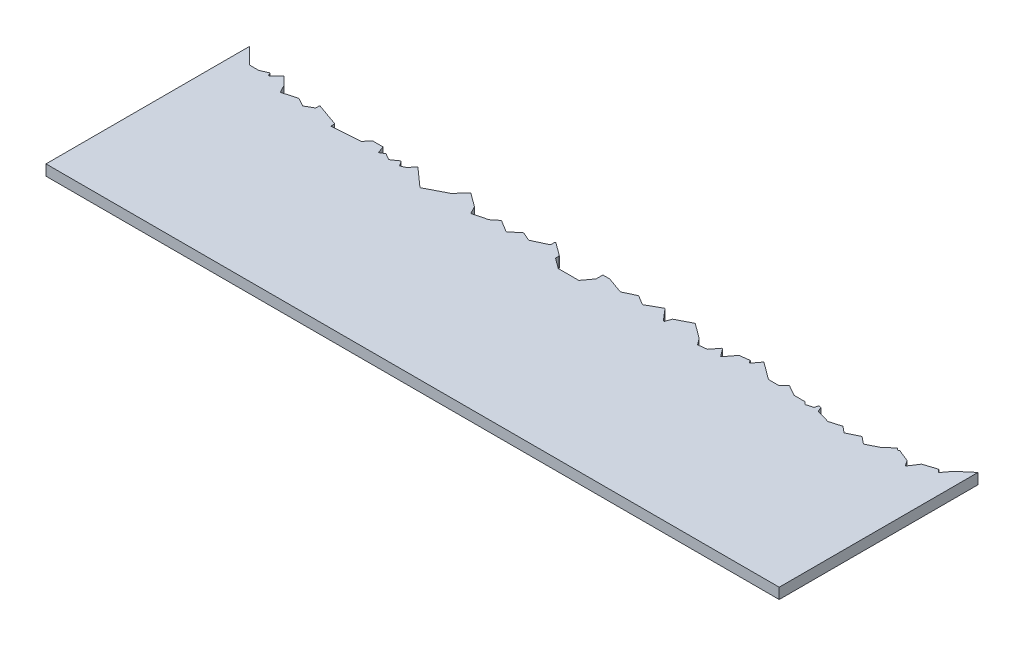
from build123d import *

# Parameters (mm, degrees)
BOSS_EXTRU_1_DEPTH      = 10
ENL_V_MAT_EXTRU_1_REACH = 1433.503
ESQUISSE2_W             = 10
ESQUISSE2_H             = 380


with BuildPart() as part:
    # Esquisse1 → Boss.-Extru.1 (new, symmetric)
    with BuildSketch(Plane(origin=(0, 0, 0), x_dir=(1, 0, 0), z_dir=(0, 1, 0))):
        with BuildLine():
            Line((0, 380), (29.60780348, 350.39219652))
            ThreePointArc((29.60780348, 350.39219652), (29.964813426, 350.153650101), (30.38593537, 350.069883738))
            Line((30.38593537, 350.069883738), (47.204004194, 350.069883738))
            ThreePointArc((47.204004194, 350.069883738), (47.428275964, 350.092979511), (47.643133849, 350.161297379))
            Line((47.643133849, 350.161297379), (61.096251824, 356.016085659))
            ThreePointArc((61.096251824, 356.016085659), (61.921316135, 356.037604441), (62.529286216, 355.479422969))
            Line((62.529286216, 355.479422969), (64.430876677, 351.478308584))
            ThreePointArc((64.430876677, 351.478308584), (65.237665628, 350.866257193), (66.202913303, 351.172545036))
            Line((66.202913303, 351.172545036), (79.287178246, 364.256809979))
            ThreePointArc((79.287178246, 364.256809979), (80.065310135, 364.579122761), (80.843442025, 364.256809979))
            Line((80.843442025, 364.256809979), (94.908965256, 350.191286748))
            ThreePointArc((94.908965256, 350.191286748), (95.019616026, 350.062033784), (95.109019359, 349.917268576))
            Line((95.109019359, 349.917268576), (102.574819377, 335.43057491))
            ThreePointArc((102.574819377, 335.43057491), (103.114892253, 334.925215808), (103.852885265, 334.875891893))
            Line((103.852885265, 334.875891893), (129.804389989, 342.226060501))
            ThreePointArc((129.804389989, 342.226060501), (130.232400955, 342.260223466), (130.640905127, 342.127993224))
            Line((130.640905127, 342.127993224), (145.531335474, 333.810636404))
            ThreePointArc((145.531335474, 333.810636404), (146.073891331, 333.670937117), (146.614912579, 333.816466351))
            Line((146.614912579, 333.816466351), (160.960487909, 342.033242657))
            ThreePointArc((160.960487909, 342.033242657), (161.365611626, 342.436282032), (161.513990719, 342.988142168))
            Line((161.513990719, 342.988142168), (161.513990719, 348.511023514))
            ThreePointArc((161.513990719, 348.511023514), (161.979799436, 349.41003168), (162.982879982, 349.547955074))
            Line((162.982879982, 349.547955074), (204.233333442, 334.890761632))
            ThreePointArc((204.233333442, 334.890761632), (204.763897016, 334.488466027), (204.965333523, 333.853830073))
            Line((204.965333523, 333.853830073), (204.965333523, 328.094555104))
            ThreePointArc((204.965333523, 328.094555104), (205.316437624, 327.288659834), (206.145705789, 326.997016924))
            Line((206.145705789, 326.997016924), (257.521561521, 330.73843443))
            ThreePointArc((257.521561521, 330.73843443), (257.928310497, 330.848995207), (258.263656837, 331.104360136))
            Line((258.263656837, 331.104360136), (267.944420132, 341.981442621))
            ThreePointArc((267.944420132, 341.981442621), (268.315954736, 342.253841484), (268.766443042, 342.35027482))
            Line((268.766443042, 342.35027482), (286.634683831, 342.35027482))
            ThreePointArc((286.634683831, 342.35027482), (287.269646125, 342.148607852), (287.671882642, 341.617521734))
            Line((287.671882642, 341.617521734), (291.760826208, 330.083269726))
            ThreePointArc((291.760826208, 330.083269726), (292.41554462, 329.419124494), (293.344966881, 329.496061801))
            Line((293.344966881, 329.496061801), (300.725341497, 333.723350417))
            ThreePointArc((300.725341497, 333.723350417), (301.266362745, 333.86887965), (301.808918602, 333.729180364))
            Line((301.808918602, 333.729180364), (312.937974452, 327.512816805))
            ThreePointArc((312.937974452, 327.512816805), (313.527040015, 327.374351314), (314.100251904, 327.568256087))
            Line((314.100251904, 327.568256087), (326.206634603, 335.934925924))
            ThreePointArc((326.206634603, 335.934925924), (327.030017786, 336.112168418), (327.737566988, 335.655277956))
            Line((327.737566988, 335.655277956), (333.256366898, 327.669698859))
            ThreePointArc((333.256366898, 327.669698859), (333.869640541, 327.234348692), (334.619311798, 327.294576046))
            Line((334.619311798, 327.294576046), (342.010502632, 330.674603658))
            ThreePointArc((342.010502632, 330.674603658), (342.206686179, 330.790228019), (342.374870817, 330.943756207))
            Line((342.374870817, 330.943756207), (351.795227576, 341.52825191))
            ThreePointArc((351.795227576, 341.52825191), (352.553320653, 341.895225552), (353.348862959, 341.618662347))
            Line((353.348862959, 341.618662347), (365.537201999, 330.770861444))
            Line((365.537201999, 330.770861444), (387.319156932, 311.384601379))
            ThreePointArc((387.319156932, 311.384601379), (387.912799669, 311.114862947), (388.554883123, 311.228438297))
            Line((388.554883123, 311.228438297), (426.293268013, 330.677129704))
            ThreePointArc((426.293268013, 330.677129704), (426.463586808, 330.785764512), (426.611177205, 330.923703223))
            Line((426.611177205, 330.923703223), (442.983894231, 349.319710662))
            ThreePointArc((442.983894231, 349.319710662), (443.691900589, 349.682620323), (444.459503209, 349.473425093))
            Line((444.459503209, 349.473425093), (456.722480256, 340.420372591))
            Line((456.722480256, 340.420372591), (469.586571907, 330.923551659))
            ThreePointArc((469.586571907, 330.923551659), (469.770840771, 330.751651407), (469.911171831, 330.542338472))
            Line((469.911171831, 330.542338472), (476.793211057, 317.188378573))
            ThreePointArc((476.793211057, 317.188378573), (477.325075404, 316.68662179), (478.053988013, 316.628950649))
            Line((478.053988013, 316.628950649), (504.009135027, 323.5254272))
            ThreePointArc((504.009135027, 323.5254272), (504.22665908, 323.608732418), (504.421776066, 323.735955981))
            Line((504.421776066, 323.735955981), (516.44666057, 333.536610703))
            ThreePointArc((516.44666057, 333.536610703), (517.071464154, 333.781786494), (517.722467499, 333.618430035))
            Line((517.722467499, 333.618430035), (538.99324515, 320.408272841))
            ThreePointArc((538.99324515, 320.408272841), (539.644248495, 320.244916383), (540.26905208, 320.490092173))
            Line((540.26905208, 320.490092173), (557.2893489, 334.36216324))
            ThreePointArc((557.2893489, 334.36216324), (557.839434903, 334.599980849), (558.432568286, 334.514280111))
            Line((558.432568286, 334.514280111), (573.953871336, 327.596418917))
            ThreePointArc((573.953871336, 327.596418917), (574.411679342, 327.501147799), (574.867714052, 327.604574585))
            Line((574.867714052, 327.604574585), (601.660133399, 340.123848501))
            ThreePointArc((601.660133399, 340.123848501), (602.122617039, 340.529920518), (602.294722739, 341.120822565))
            Line((602.294722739, 341.120822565), (602.294722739, 347.889656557))
            ThreePointArc((602.294722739, 347.889656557), (602.899313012, 348.872055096), (604.048753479, 348.774983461))
            Line((604.048753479, 348.774983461), (627.989706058, 331.100751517))
            ThreePointArc((627.989706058, 331.100751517), (628.31851853, 330.711279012), (628.436564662, 330.215424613))
            Line((628.436564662, 330.215424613), (628.436564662, 324.141706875))
            ThreePointArc((628.436564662, 324.141706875), (628.554610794, 323.645852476), (628.883423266, 323.256379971))
            Line((628.883423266, 323.256379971), (647.609211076, 309.432205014))
            ThreePointArc((647.609211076, 309.432205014), (647.918758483, 309.272249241), (648.262797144, 309.217087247))
            Line((648.262797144, 309.217087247), (685.840229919, 309.217087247))
            ThreePointArc((685.840229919, 309.217087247), (686.336084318, 309.335133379), (686.725556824, 309.663945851))
            Line((686.725556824, 309.663945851), (699.784882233, 327.353692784))
            ThreePointArc((699.784882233, 327.353692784), (699.944838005, 327.663240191), (700, 328.007278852))
            Line((700, 328.007278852), (700, 339.319927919))
            ThreePointArc((700, 339.319927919), (700.322312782, 340.098059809), (701.100444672, 340.420372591))
            Line((701.100444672, 340.420372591), (712.706722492, 340.420372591))
            ThreePointArc((712.706722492, 340.420372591), (712.893661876, 340.404378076), (713.075167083, 340.356859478))
            Line((713.075167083, 340.356859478), (743.409644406, 329.578352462))
            ThreePointArc((743.409644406, 329.578352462), (743.834528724, 329.516287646), (744.250819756, 329.62155161))
            Line((744.250819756, 329.62155161), (766.414033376, 340.164865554))
            ThreePointArc((766.414033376, 340.164865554), (766.94339493, 340.270119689), (767.45913389, 340.111011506))
            Line((767.45913389, 340.111011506), (784.455939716, 329.760249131))
            ThreePointArc((784.455939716, 329.760249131), (785.008399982, 329.59986294), (785.566301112, 329.740156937))
            Line((785.566301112, 329.740156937), (811.296301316, 344.159896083))
            ThreePointArc((811.296301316, 344.159896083), (812.028959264, 344.283015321), (812.672891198, 343.912478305))
            Line((812.672891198, 343.912478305), (824.982210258, 329.425729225))
            Line((824.982210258, 329.425729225), (830.906013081, 322.971360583))
            ThreePointArc((830.906013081, 322.971360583), (831.936000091, 322.637073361), (832.753685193, 323.347011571))
            Line((832.753685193, 323.347011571), (836.404773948, 333.622448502))
            ThreePointArc((836.404773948, 333.622448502), (836.613061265, 333.978108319), (836.93759179, 334.232189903))
            Line((836.93759179, 334.232189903), (863.978558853, 348.167906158))
            ThreePointArc((863.978558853, 348.167906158), (864.570656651, 348.286641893), (865.136258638, 348.07504707))
            Line((865.136258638, 348.07504707), (892.677648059, 327.74281914))
            ThreePointArc((892.677648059, 327.74281914), (892.801393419, 327.636423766), (892.908043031, 327.512897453))
            Line((892.908043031, 327.512897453), (901.137634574, 316.413195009))
            ThreePointArc((901.137634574, 316.413195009), (901.590767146, 316.056005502), (902.162345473, 315.977191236))
            Line((902.162345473, 315.977191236), (917.650773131, 317.974319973))
            ThreePointArc((917.650773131, 317.974319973), (918.057724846, 318.111253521), (918.381297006, 318.393497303))
            Line((918.381297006, 318.393497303), (929.559289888, 332.880866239))
            ThreePointArc((929.559289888, 332.880866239), (930.441092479, 333.30902869), (931.314524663, 332.864039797))
            Line((931.314524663, 332.864039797), (941.444414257, 319.201300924))
            ThreePointArc((941.444414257, 319.201300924), (942.31784644, 318.756312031), (943.199649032, 319.184474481))
            Line((943.199649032, 319.184474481), (957.100476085, 337.20080462))
            ThreePointArc((957.100476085, 337.20080462), (957.424048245, 337.483048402), (957.83099996, 337.61998195))
            Line((957.83099996, 337.61998195), (975.421695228, 339.888183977))
            ThreePointArc((975.421695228, 339.888183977), (976.060281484, 339.77816048), (976.526239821, 339.327849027))
            Line((976.526239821, 339.327849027), (978.614961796, 335.537151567))
            ThreePointArc((978.614961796, 335.537151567), (979.506027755, 334.970188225), (980.464103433, 335.414639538))
            Line((980.464103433, 335.414639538), (990.629643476, 349.184556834))
            ThreePointArc((990.629643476, 349.184556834), (991.351104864, 349.619146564), (992.168556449, 349.41629767))
            Line((992.168556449, 349.41629767), (1013.006650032, 334.032728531))
            Line((1013.006650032, 334.032728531), (1023.551882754, 326.247788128))
            ThreePointArc((1023.551882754, 326.247788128), (1023.861430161, 326.087832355), (1024.205468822, 326.03267036))
            Line((1024.205468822, 326.03267036), (1043.295181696, 326.03267036))
            ThreePointArc((1043.295181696, 326.03267036), (1043.71630364, 326.116436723), (1044.073313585, 326.354983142))
            Line((1044.073313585, 326.354983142), (1052.848396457, 335.130066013))
            ThreePointArc((1052.848396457, 335.130066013), (1053.47880231, 335.442418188), (1054.169589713, 335.309045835))
            Line((1054.169589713, 335.309045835), (1073.24956889, 324.483141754))
            ThreePointArc((1073.24956889, 324.483141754), (1073.511801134, 324.376245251), (1073.792630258, 324.339808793))
            Line((1073.792630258, 324.339808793), (1093.698125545, 324.339808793))
            ThreePointArc((1093.698125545, 324.339808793), (1094.11924749, 324.256042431), (1094.476257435, 324.017496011))
            Line((1094.476257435, 324.017496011), (1098.290549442, 320.203204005))
            ThreePointArc((1098.290549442, 320.203204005), (1098.797611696, 319.914799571), (1099.38084548, 319.926095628))
            Line((1099.38084548, 319.926095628), (1111.169974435, 323.413588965))
            ThreePointArc((1111.169974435, 323.413588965), (1111.641755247, 323.696554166), (1111.917613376, 324.172525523))
            Line((1111.917613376, 324.172525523), (1113.400502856, 329.476444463))
            ThreePointArc((1113.400502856, 329.476444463), (1113.920430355, 330.139053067), (1114.756609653, 330.239943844))
            Line((1114.756609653, 330.239943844), (1118.369308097, 329.229892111))
            ThreePointArc((1118.369308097, 329.229892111), (1118.845279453, 328.954033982), (1119.128244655, 328.48225317))
            Line((1119.128244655, 328.48225317), (1121.073124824, 321.907776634))
            ThreePointArc((1121.073124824, 321.907776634), (1121.35054724, 321.44149498), (1121.817052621, 321.164448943))
            Line((1121.817052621, 321.164448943), (1147.146845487, 313.693542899))
            ThreePointArc((1147.146845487, 313.693542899), (1147.458601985, 313.648590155), (1147.770322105, 313.693794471))
            Line((1147.770322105, 313.693794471), (1168.431597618, 319.805871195))
            ThreePointArc((1168.431597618, 319.805871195), (1168.957974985, 319.83002482), (1169.435236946, 319.606691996))
            Line((1169.435236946, 319.606691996), (1180.335773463, 310.801887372))
            ThreePointArc((1180.335773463, 310.801887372), (1180.903516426, 310.564482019), (1181.509952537, 310.669022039))
            Line((1181.509952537, 310.669022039), (1202.729726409, 321.026585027))
            ThreePointArc((1202.729726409, 321.026585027), (1203.336162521, 321.131125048), (1203.903905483, 320.893719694))
            Line((1203.903905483, 320.893719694), (1216.397809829, 310.801887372))
            ThreePointArc((1216.397809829, 310.801887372), (1216.965552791, 310.564482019), (1217.571988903, 310.669022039))
            Line((1217.571988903, 310.669022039), (1239.273834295, 321.261888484))
            ThreePointArc((1239.273834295, 321.261888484), (1239.414257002, 321.343791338), (1239.54108151, 321.44548774))
            Line((1239.54108151, 321.44548774), (1254.173624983, 335.071865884))
            ThreePointArc((1254.173624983, 335.071865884), (1254.884867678, 335.366302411), (1255.615051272, 335.122599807))
            Line((1255.615051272, 335.122599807), (1258.40403814, 332.869822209))
            ThreePointArc((1258.40403814, 332.869822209), (1259.235669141, 332.634400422), (1259.980840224, 333.072297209))
            Line((1259.980840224, 333.072297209), (1260.183966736, 333.347445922))
            ThreePointArc((1260.183966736, 333.347445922), (1260.769254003, 333.752611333), (1261.48008945, 333.714754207))
            Line((1261.48008945, 333.714754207), (1284.150869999, 324.592300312))
            ThreePointArc((1284.150869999, 324.592300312), (1284.434418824, 324.425141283), (1284.655847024, 324.181601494))
            Line((1284.655847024, 324.181601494), (1290.784784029, 314.983379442))
            ThreePointArc((1290.784784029, 314.983379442), (1291.703286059, 314.493133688), (1292.619345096, 314.98792932))
            Line((1292.619345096, 314.98792932), (1303.717779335, 331.82468969))
            ThreePointArc((1303.717779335, 331.82468969), (1303.970558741, 332.095063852), (1304.298684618, 332.266332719))
            Line((1304.298684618, 332.266332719), (1327.528397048, 339.760850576))
            ThreePointArc((1327.528397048, 339.760850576), (1328.161467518, 339.773676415), (1328.696804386, 339.43550906))
            Line((1328.696804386, 339.43550906), (1332.41413396, 335.15911183))
            ThreePointArc((1332.41413396, 335.15911183), (1333.288466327, 334.781486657), (1334.129985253, 335.227472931))
            Line((1334.129985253, 335.227472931), (1345.013063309, 349.969344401))
            ThreePointArc((1345.013063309, 349.969344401), (1345.092465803, 350.065067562), (1345.182162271, 350.151219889))
            Line((1345.182162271, 350.151219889), (1380, 380))
            Line((1380, 380), (1380, 0))
            Line((1380, 0), (0, 0))
            Line((0, 0), (0, 380))
        make_face()
    extrude(amount=BOSS_EXTRU_1_DEPTH, both=True)

    # Esquisse2 → Enl_v. mat.-Extru.1 (cut, up to next)
    with BuildSketch(Plane(origin=(0, 10, 0), x_dir=(1, 0, 0), z_dir=(0, 1, 0)), mode=Mode.PRIVATE) as enl_v_mat_extru_1_sk1:
        with Locations((1375, 190)):
            Rectangle(ESQUISSE2_W, ESQUISSE2_H)
    enl_v_mat_extru_1_tool1 = extrude(enl_v_mat_extru_1_sk1.sketch, amount=-ENL_V_MAT_EXTRU_1_REACH, mode=Mode.PRIVATE) & part.part
    add(enl_v_mat_extru_1_tool1.solids().sort_by_distance((1375, 10, -190))[0], mode=Mode.SUBTRACT)


solid = part.part
